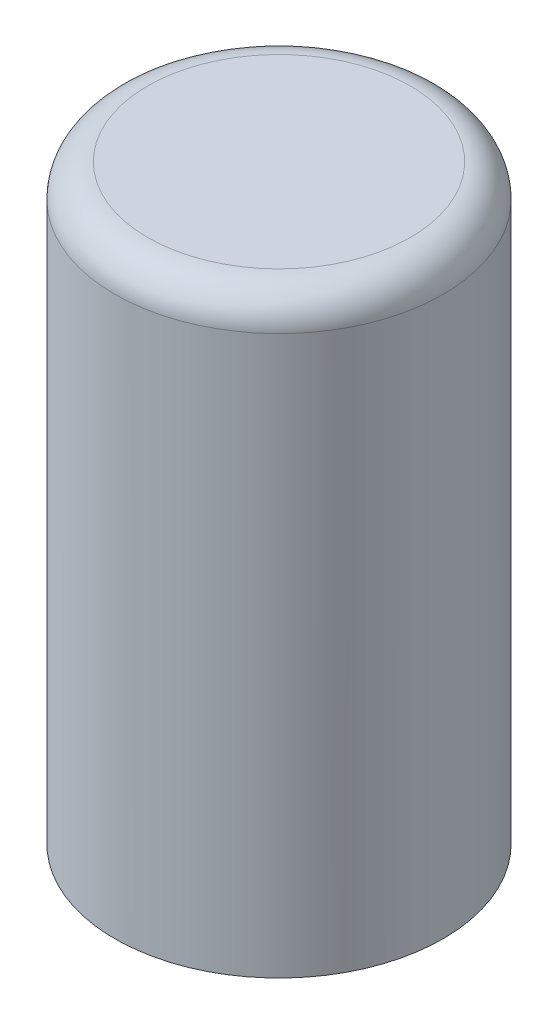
ISO-10303-21;
HEADER;
FILE_DESCRIPTION(('STEP AP214'),'2;1');
FILE_NAME('part.step','',(''),(''),'','','');
FILE_SCHEMA(('AUTOMOTIVE_DESIGN { 1 0 10303 214 1 1 1 1 }'));
ENDSEC;
DATA;
#1=APPLICATION_CONTEXT('core data for automotive mechanical design processes');
#2=APPLICATION_PROTOCOL_DEFINITION('international standard','automotive_design',2000,#1);
#3=PRODUCT_CONTEXT('',#1,'mechanical');
#4=PRODUCT('Part','Part','',(#3));
#5=PRODUCT_RELATED_PRODUCT_CATEGORY('part','',(#4));
#6=PRODUCT_DEFINITION_FORMATION('','',#4);
#7=PRODUCT_DEFINITION_CONTEXT('part definition',#1,'design');
#8=PRODUCT_DEFINITION('design','',#6,#7);
#9=PRODUCT_DEFINITION_SHAPE('','',#8);
#10=(LENGTH_UNIT() NAMED_UNIT(*) SI_UNIT(.MILLI.,.METRE.));
#11=(NAMED_UNIT(*) PLANE_ANGLE_UNIT() SI_UNIT($,.RADIAN.));
#12=(NAMED_UNIT(*) SI_UNIT($,.STERADIAN.) SOLID_ANGLE_UNIT());
#13=UNCERTAINTY_MEASURE_WITH_UNIT(LENGTH_MEASURE(1.E-05),#10,'distance_accuracy_value','');
#14=(GEOMETRIC_REPRESENTATION_CONTEXT(3) GLOBAL_UNCERTAINTY_ASSIGNED_CONTEXT((#13)) GLOBAL_UNIT_ASSIGNED_CONTEXT((#10,
#11,#12)) REPRESENTATION_CONTEXT('',''));
#15=CARTESIAN_POINT('',(0.,0.,0.));
#16=DIRECTION('',(0.,0.,1.));
#17=DIRECTION('',(1.,0.,0.));
#18=AXIS2_PLACEMENT_3D('',#15,#16,#17);
#19=CARTESIAN_POINT('',(0.,13.2302237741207,0.));
#20=DIRECTION('',(0.,1.,0.));
#21=DIRECTION('',(0.,0.,1.));
#22=AXIS2_PLACEMENT_3D('',#19,#20,#21);
#23=PLANE('',#22);
#24=CARTESIAN_POINT('',(0.,13.2302237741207,0.));
#25=DIRECTION('',(0.,1.,0.));
#26=DIRECTION('',(0.,0.,1.));
#27=AXIS2_PLACEMENT_3D('',#24,#25,#26);
#28=CIRCLE('',#27,2.54);
#29=CARTESIAN_POINT('',(0.,13.2302237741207,2.54));
#30=VERTEX_POINT('',#29);
#31=EDGE_CURVE('E11',#30,#30,#28,.T.);
#32=ORIENTED_EDGE('',*,*,#31,.T.);
#33=EDGE_LOOP('',(#32));
#34=FACE_BOUND('',#33,.T.);
#35=ADVANCED_FACE('F30',(#34),#23,.T.);
#36=CARTESIAN_POINT('',(0.,0.,0.));
#37=DIRECTION('',(0.,-1.,0.));
#38=DIRECTION('',(0.,0.,-1.));
#39=AXIS2_PLACEMENT_3D('',#36,#37,#38);
#40=CYLINDRICAL_SURFACE('',#39,3.175);
#41=CARTESIAN_POINT('',(0.,12.5952237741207,0.));
#42=DIRECTION('',(0.,1.,0.));
#43=DIRECTION('',(0.,0.,1.));
#44=AXIS2_PLACEMENT_3D('',#41,#42,#43);
#45=CIRCLE('',#44,3.175);
#46=CARTESIAN_POINT('',(0.,12.5952237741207,3.175));
#47=VERTEX_POINT('',#46);
#48=EDGE_CURVE('E36',#47,#47,#45,.F.);
#49=ORIENTED_EDGE('',*,*,#48,.T.);
#50=EDGE_LOOP('',(#49));
#51=FACE_BOUND('',#50,.T.);
#52=CARTESIAN_POINT('',(0.,1.80022377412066,0.));
#53=DIRECTION('',(0.,-1.,0.));
#54=DIRECTION('',(0.,0.,-1.));
#55=AXIS2_PLACEMENT_3D('',#52,#53,#54);
#56=CIRCLE('',#55,3.175);
#57=CARTESIAN_POINT('',(0.,1.80022377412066,-3.175));
#58=VERTEX_POINT('',#57);
#59=EDGE_CURVE('E65',#58,#58,#56,.T.);
#60=ORIENTED_EDGE('',*,*,#59,.F.);
#61=EDGE_LOOP('',(#60));
#62=FACE_BOUND('',#61,.T.);
#63=ADVANCED_FACE('F51',(#51,#62),#40,.T.);
#64=CARTESIAN_POINT('',(0.,1.80022377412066,-3.175));
#65=DIRECTION('',(0.,-1.,0.));
#66=DIRECTION('',(0.,0.,-1.));
#67=AXIS2_PLACEMENT_3D('',#64,#65,#66);
#68=PLANE('',#67);
#69=ORIENTED_EDGE('',*,*,#59,.T.);
#70=EDGE_LOOP('',(#69));
#71=FACE_BOUND('',#70,.T.);
#72=CARTESIAN_POINT('',(0.,1.80022377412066,0.));
#73=DIRECTION('',(0.,-1.,0.));
#74=DIRECTION('',(0.,0.,-1.));
#75=AXIS2_PLACEMENT_3D('',#72,#73,#74);
#76=CIRCLE('',#75,2.794);
#77=CARTESIAN_POINT('',(0.,1.80022377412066,-2.794));
#78=VERTEX_POINT('',#77);
#79=EDGE_CURVE('E67',#78,#78,#76,.T.);
#80=ORIENTED_EDGE('',*,*,#79,.F.);
#81=EDGE_LOOP('',(#80));
#82=FACE_BOUND('',#81,.T.);
#83=ADVANCED_FACE('F42',(#71,#82),#68,.T.);
#84=CARTESIAN_POINT('',(0.,4.14466814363,0.));
#85=DIRECTION('',(0.,-1.,0.));
#86=DIRECTION('',(0.,0.,-1.));
#87=AXIS2_PLACEMENT_3D('',#84,#85,#86);
#88=CONICAL_SURFACE('',#87,0.,0.872664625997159);
#89=ORIENTED_EDGE('',*,*,#79,.T.);
#90=EDGE_LOOP('',(#89));
#91=FACE_BOUND('',#90,.T.);
#92=CARTESIAN_POINT('',(0.,4.14466814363,0.));
#93=VERTEX_POINT('',#92);
#94=VERTEX_LOOP('',#93);
#95=FACE_BOUND('',#94,.T.);
#96=ADVANCED_FACE('F39',(#91,#95),#88,.F.);
#97=CARTESIAN_POINT('',(0.,12.5952237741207,0.));
#98=DIRECTION('',(0.,1.,0.));
#99=DIRECTION('',(0.,0.,1.));
#100=AXIS2_PLACEMENT_3D('',#97,#98,#99);
#101=TOROIDAL_SURFACE('',#100,2.54,0.635);
#102=ORIENTED_EDGE('',*,*,#31,.F.);
#103=EDGE_LOOP('',(#102));
#104=FACE_BOUND('',#103,.T.);
#105=ORIENTED_EDGE('',*,*,#48,.F.);
#106=EDGE_LOOP('',(#105));
#107=FACE_BOUND('',#106,.T.);
#108=ADVANCED_FACE('F41',(#104,#107),#101,.T.);
#109=CLOSED_SHELL('',(#35,#63,#83,#96,#108));
#110=MANIFOLD_SOLID_BREP('B2',#109);
#111=ADVANCED_BREP_SHAPE_REPRESENTATION('',(#18,#110),#14);
#112=SHAPE_DEFINITION_REPRESENTATION(#9,#111);
ENDSEC;
END-ISO-10303-21;
